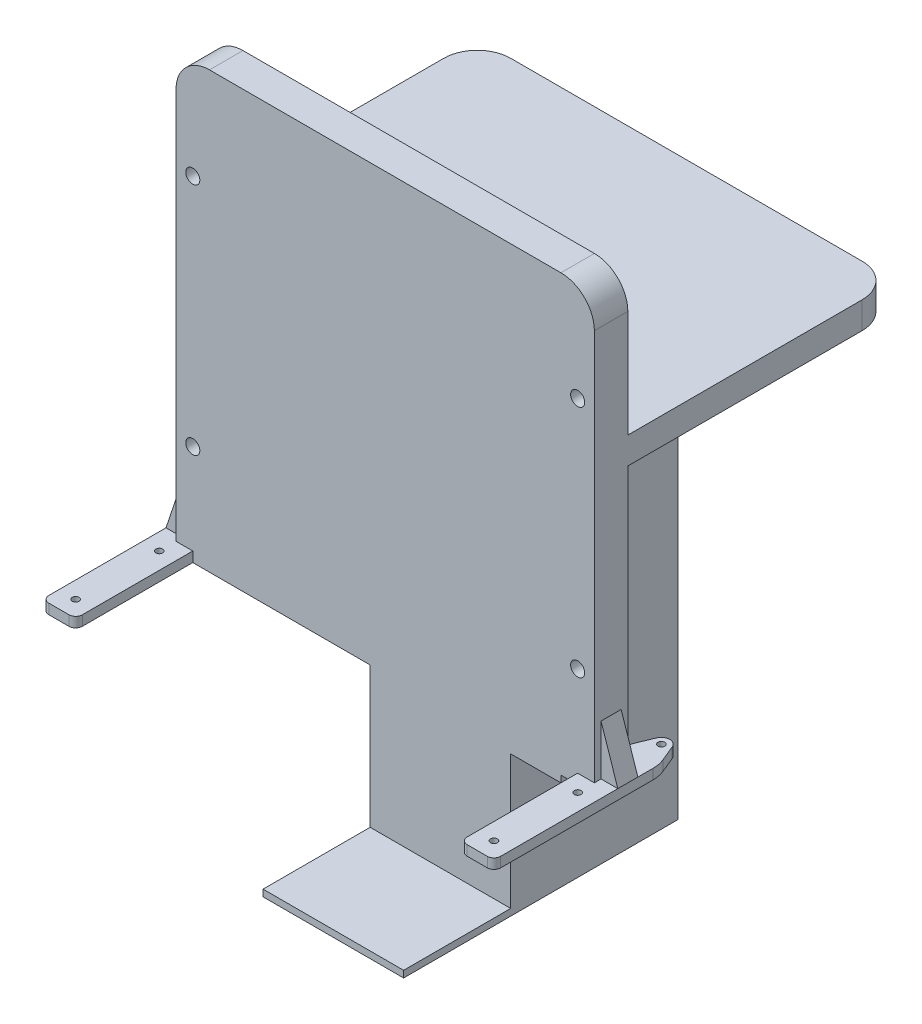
from build123d import *

# Parameters (mm, degrees)
EXTRUDE_1_DEPTH               = 3
EXTRUDE_1_2_DEPTH             = 3
HOLE_WIZARD_M2_5_2_AT_2_COUNT = 2
HOLE_WIZARD_M2_5_2_AT_2_PITCH = 125
PATTERN_LINEAR_1_COUNT        = 2
PATTERN_LINEAR_1_PITCH        = 25
SKETCH_4_W                    = 125
SKETCH_4_H                    = 130
EXTRUDE_2_DEPTH               = 5
EXTRUDE_3_DEPTH               = 3
SKETCH_6_W                    = 125
SKETCH_6_H                    = 8
EXTRUDE_4_DEPTH               = 80
EXTRUDE_START                 = -3
EXTRUDE_17_DEPTH              = 3
FILLET_1_R                    = 10
SKETCH_10_W                   = 15
SKETCH_10_H                   = 2
EXTRUDE_7_DEPTH               = 5
SKETCH_15_W                   = 75
SKETCH_15_H                   = 10
EXTRUDE_12_DEPTH              = 44
SKETCH_17_W                   = 75
SKETCH_17_H                   = 2
EXTRUDE_14_DEPTH              = 32
SKETCH_19_W                   = 75
SKETCH_19_H                   = 2
EXTRUDE_15_DEPTH              = 40
HOLE_WIZARD_M5_1_D            = 4.2
HOLE_WIZARD_M5_1_DEPTH        = 12.4
HOLE_WIZARD_M5_1_TIP          = 1.2618073
RIB_1_REACH                   = 207.73
SKETCH_29_WALL_W              = 535.460812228
SKETCH_29_WALL_H              = 10
CUT_EXTRUDE_1_DEPTH           = 172.91931247
CUT_EXTRUDE_1_DEPTH_BACK      = 45


with BuildPart() as part:
    # Sketch 1 → Extrude 1 (new body)
    with BuildSketch(Plane(origin=(0, 0, 0), x_dir=(1, 0, 0), z_dir=(0, 1, 0))):
        with BuildLine():
            Line((-64.809698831, 50.956708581), (-66.738795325, 46.299457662))
            ThreePointArc((-66.738795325, 46.299457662), (-67.307852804, 44.423526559), (-67.5, 42.472623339))
            Line((-67.5, 42.472623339), (-67.5, 22))
            ThreePointArc((-67.5, 22), (-66.914213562, 20.585786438), (-65.5, 20))
            Line((-65.5, 20), (-59.5, 20))
            ThreePointArc((-59.5, 20), (-58.085786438, 20.585786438), (-57.5, 22))
            Line((-57.5, 22), (-57.5, 42.472623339))
            ThreePointArc((-57.5, 42.472623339), (-57.692147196, 44.423526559), (-58.261204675, 46.299457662))
            Line((-58.261204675, 46.299457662), (-60.190301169, 50.956708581))
            ThreePointArc((-60.190301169, 50.956708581), (-62.5, 52.5), (-64.809698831, 50.956708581))
        make_face()
    extrude(amount=EXTRUDE_1_DEPTH)

    # Sketch 2 → Hole Wizard M2.5 _2 (revolve, cut)
    with BuildSketch(Plane(origin=(-62.5, 3, -50), x_dir=(0, 0, 1), z_dir=(1, 0, 0))):
        Polygon((0, 0), (0, 7.865882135), (1.025, 7.25), (1.025, 0), align=None)
    hole_wizard_m2_5_2 = revolve(axis=Axis((-62.5, 9.35, -50), (0, -1, 0)), mode=Mode.SUBTRACT)

    # Pattern Linear 1: Hole Wizard M2.5 _2 ×2
    with Locations(*[(0, 0, i * PATTERN_LINEAR_1_PITCH) for i in range(1, PATTERN_LINEAR_1_COUNT)]):
        add(hole_wizard_m2_5_2, mode=Mode.SUBTRACT)



with BuildPart() as body_2:
    # Sketch 1 → Extrude 1 2 (new body)
    with BuildSketch(Plane(origin=(0, 0, 0), x_dir=(1, 0, 0), z_dir=(0, 1, 0))):
        with BuildLine():
            Line((60.190301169, 50.956708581), (58.261204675, 46.299457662))
            ThreePointArc((58.261204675, 46.299457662), (57.692147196, 44.423526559), (57.5, 42.472623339))
            Line((57.5, 42.472623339), (57.5, 22))
            ThreePointArc((57.5, 22), (58.085786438, 20.585786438), (59.5, 20))
            Line((59.5, 20), (65.5, 20))
            ThreePointArc((65.5, 20), (66.914213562, 20.585786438), (67.5, 22))
            Line((67.5, 22), (67.5, 42.472623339))
            ThreePointArc((67.5, 42.472623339), (67.307852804, 44.423526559), (66.738795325, 46.299457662))
            Line((66.738795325, 46.299457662), (64.809698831, 50.956708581))
            ThreePointArc((64.809698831, 50.956708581), (62.5, 52.5), (60.190301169, 50.956708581))
        make_face()
    extrude(amount=EXTRUDE_1_2_DEPTH)

    # Hole Wizard M2.5 _2 at 2: Hole Wizard M2.5 _2 ×2
    with Locations(*[(i * HOLE_WIZARD_M2_5_2_AT_2_PITCH, 0, 0) for i in range(1, HOLE_WIZARD_M2_5_2_AT_2_COUNT)]):
        add(hole_wizard_m2_5_2, mode=Mode.SUBTRACT)

    # Pattern Linear 1 copy 1 sketch → Pattern Linear 1 copy 1 (revolve, cut)
    with BuildSketch(Plane(origin=(62.5, 3, -25), x_dir=(0, 0, 1), z_dir=(1, 0, 0))):
        Polygon((0, 0), (0, 7.865882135), (1.025, 7.25), (1.025, 0), align=None)
    revolve(axis=Axis((62.5, 9.35, -25), (0, -1, 0)), mode=Mode.SUBTRACT)


with BuildPart() as part_1:
    add(part.part)

    add(body_2.part)  # Extrude 2 merges body 2
    # Sketch 4 → Extrude 2 (add, symmetric)
    with BuildSketch(Plane.XY.offset(-35)):
        with Locations((0, 65)):
            Rectangle(SKETCH_4_W, SKETCH_4_H)
    extrude(amount=EXTRUDE_2_DEPTH, both=True)

    # Sketch 5 → Extrude 3 (add, symmetric)
    with BuildSketch(Plane.XY.offset(-35)):
        Polygon((-67.5, 3), (-62.5, 18), (-62.5, 3), align=None)
        Polygon((62.5, 3), (62.5, 18), (67.5, 3), align=None)
    extrude(amount=EXTRUDE_3_DEPTH, both=True)

    # Sketch 6 → Extrude 4 (add)
    with BuildSketch(Plane(origin=(0, 0, -40), x_dir=(-1, 0, 0), z_dir=(0, 0, -1))):
        with Locations((0, 84)):
            Rectangle(SKETCH_6_W, SKETCH_6_H)
    extrude(amount=EXTRUDE_4_DEPTH)

    # Sketch 23 → Extrude 17 (add)
    with BuildSketch(Plane(origin=(0, 3, 0), x_dir=(1, 0, 0), z_dir=(0, 1, 0)).offset(EXTRUDE_START)):
        with BuildLine():
            Line((-67.5, 22), (-67.5, -3))
            ThreePointArc((-67.5, -3), (-66.914213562, -4.414213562), (-65.5, -5))
            Line((-65.5, -5), (-59.5, -5))
            ThreePointArc((-59.5, -5), (-58.085786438, -4.414213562), (-57.5, -3))
            Line((-57.5, -3), (-57.5, 22))
            ThreePointArc((-57.5, 22), (-58.085786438, 20.585786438), (-59.5, 20))
            Line((-59.5, 20), (-65.5, 20))
            ThreePointArc((-65.5, 20), (-66.914213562, 20.585786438), (-67.5, 22))
        make_face()
    extrude_17 = extrude(amount=EXTRUDE_17_DEPTH)

    # Fillet 1
    fillet_1_edges = [part_1.edges().sort_by_distance(p)[0] for p in [
        (62.5, 84, -120),
        (-62.5, 84, -120),
        (-62.5, 130, -35),
        (62.5, 130, -35),
    ]]
    fillet(fillet_1_edges, radius=FILLET_1_R)

    # Sketch 10 → Extrude 7 (add, symmetric)
    with BuildSketch(Plane.XY.offset(-35)):
        with Locations((45, -1)):
            Rectangle(SKETCH_10_W, SKETCH_10_H)
    extrude_7 = extrude(amount=EXTRUDE_7_DEPTH, both=True)

    # Mirror 2: Extrude 7 across plane
    add(extrude_7.mirror(Plane(origin=(0, 0, 0), x_dir=(0, 0, 1), z_dir=(1, 0, 0))))

    # Sketch 15 → Extrude 12 (add)
    with BuildSketch(Plane.XZ):
        with Locations((0, -35)):
            Rectangle(SKETCH_15_W, SKETCH_15_H)
    extrude(amount=EXTRUDE_12_DEPTH)

    # Sketch 17 → Extrude 14 (add)
    with BuildSketch(Plane.XY.offset(-30)):
        with Locations((0, -43)):
            Rectangle(SKETCH_17_W, SKETCH_17_H)
    extrude(amount=EXTRUDE_14_DEPTH)

    # Sketch 19 → Extrude 15 (add)
    with BuildSketch(Plane(origin=(0, 0, -40), x_dir=(-1, 0, 0), z_dir=(0, 0, -1))):
        with Locations((0, -43)):
            Rectangle(SKETCH_19_W, SKETCH_19_H)
    extrude(amount=EXTRUDE_15_DEPTH)

    # Sketch 26 → Hole Wizard M2.5 _1 (revolve, cut)
    with BuildSketch(Plane(origin=(-62.5, 3, 0), x_dir=(0, 0, 1), z_dir=(1, 0, 0))):
        Polygon((0, 0), (0, 7.865882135), (1.025, 7.25), (1.025, 0), align=None)
    hole_wizard_m2_5_1 = revolve(axis=Axis((-62.5, 9.35, 0), (0, -1, 0)), mode=Mode.SUBTRACT)

    # Mirror 3: Extrude 17, Hole Wizard M2.5 _1 across plane
    add(extrude_17.mirror(Plane(origin=(0, 0, 0), x_dir=(0, 0, 1), z_dir=(1, 0, 0))))
    add(hole_wizard_m2_5_1.mirror(Plane(origin=(0, 0, 0), x_dir=(0, 0, 1), z_dir=(1, 0, 0))), mode=Mode.SUBTRACT)

    # Hole Wizard M5 _1
    with Locations(Plane(origin=(-57.5, 100, -30), x_dir=(1, 0, 0), z_dir=(0, 0, 1))):
        with Locations((0, 0), (115, 0), (0, -70), (115, -70)):
            Hole(HOLE_WIZARD_M5_1_D / 2, depth=HOLE_WIZARD_M5_1_DEPTH)
            with Locations((0, 0, -(HOLE_WIZARD_M5_1_DEPTH + HOLE_WIZARD_M5_1_TIP / 2))):  # 118° drill point
                Cone(0, HOLE_WIZARD_M5_1_D / 2, HOLE_WIZARD_M5_1_TIP, mode=Mode.SUBTRACT)

    # Sketch 29 wall → Rib 1 (add, up to next)
    with BuildSketch(Plane(origin=(-37.5, 19, -80), x_dir=(0, 1, 0), z_dir=(0, 0, -1)), mode=Mode.PRIVATE) as rib_1_sk1:
        with Locations((0, 5)):
            Rectangle(SKETCH_29_WALL_W, SKETCH_29_WALL_H)
    rib_1_tool1 = extrude(rib_1_sk1.sketch, amount=-RIB_1_REACH, mode=Mode.PRIVATE) - part_1.part
    rib_1 = rib_1_tool1.solids().sort_by_distance((-37.5, 19, -80))[0]
    add(rib_1)

    # Mirror 4: Rib 1 across plane
    add(rib_1.mirror(Plane(origin=(0, 0, 0), x_dir=(0, 0, 1), z_dir=(1, 0, 0))))

    # Sketch 30 → Cut-Extrude 1 (cut, two sides: drawn at the far end of the back side and taken through both)
    with BuildSketch(Plane.XY.offset(-30).offset(-CUT_EXTRUDE_1_DEPTH_BACK)):
        Polygon((-4.5, -2), (-4.5, -44), (-37.5, -44), (-37.5, -2), (-52.5, -2), (-52.5, 0), (-4.5, 0), align=None)
    extrude(amount=CUT_EXTRUDE_1_DEPTH + CUT_EXTRUDE_1_DEPTH_BACK, mode=Mode.SUBTRACT)


solid = part_1.part
